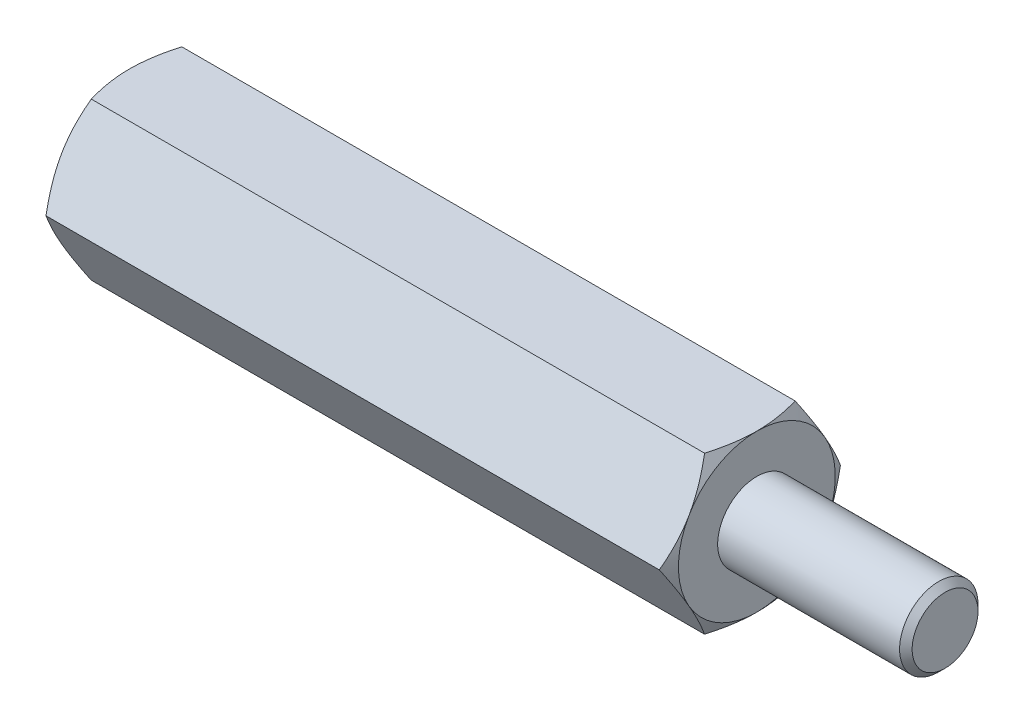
from build123d import *

# Parameters (mm, degrees)
EXTRUDE2_DEPTH = 10
SKETCH3_R      = 1.05
EXTRUDE3_DEPTH = 6
SKETCH5_R      = 1.25
EXTRUDE4_DEPTH = 6
CHAMFER1_SIZE  = 0.2


with BuildPart() as part:
    # Sketch1 → Extrude2 (new, symmetric)
    with BuildSketch(Plane(origin=(0, 0, 0), x_dir=(0, 0, -1), z_dir=(1, 0, 0))):
        Polygon((1.443375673, 2.5), (-1.443375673, 2.5), (-2.886751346, 0), (-1.443375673, -2.5), (1.443375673, -2.5), (2.886751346, 0), align=None)
    extrude(amount=EXTRUDE2_DEPTH, both=True)

    # Sketch2 → Cut-Revolve1 (revolve, cut)
    with BuildSketch(Plane.XY):
        with BuildLine():
            Line((-10, 2.5), (-8.5, 5.098076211))
            ThreePointArc((-8.5, 5.098076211), (-8.98810136, 6.276457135), (-10, 5.5))
            Line((-10, 5.5), (-10, 2.5))
        make_face()
    cut_revolve1 = revolve(axis=Axis((0, 0, 0), (1, 0, 0)), mode=Mode.SUBTRACT)

    # Mirror1: Cut-Revolve1 across plane
    add(cut_revolve1.mirror(Plane(origin=(0, 0, 0), x_dir=(0, 0, 1), z_dir=(1, 0, 0))), mode=Mode.SUBTRACT)

    # Sketch3 → Extrude3 (cut)
    with BuildSketch(Plane.ZY.offset(10)):
        Circle(SKETCH3_R)
    extrude(amount=-EXTRUDE3_DEPTH, mode=Mode.SUBTRACT)

    # Sketch4 → Cut-Revolve2 (revolve, cut)
    with BuildSketch(Plane.XY, mode=Mode.PRIVATE) as cut_revolve2_sk:
        Polygon((-4, 0), (-4, 1.05), (-3.393782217, 0), align=None)
    revolve(cut_revolve2_sk.sketch.rotate(Axis((-3.393782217, 0, 0), (-1, 0, 0)), 270), axis=Axis((-3.393782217, 0, 0), (-1, 0, 0)), mode=Mode.SUBTRACT)

    # Sketch5 → Extrude4 (add)
    with BuildSketch(Plane(origin=(10, 0, 0), x_dir=(0, 0, -1), z_dir=(1, 0, 0))):
        Circle(SKETCH5_R)
    extrude(amount=EXTRUDE4_DEPTH)

    # Chamfer1
    chamfer1_edges = [part.edges().sort_by_distance(p)[0] for p in [
        (16, 0, 1.25),
    ]]
    chamfer(chamfer1_edges, length=CHAMFER1_SIZE)


solid = part.part
